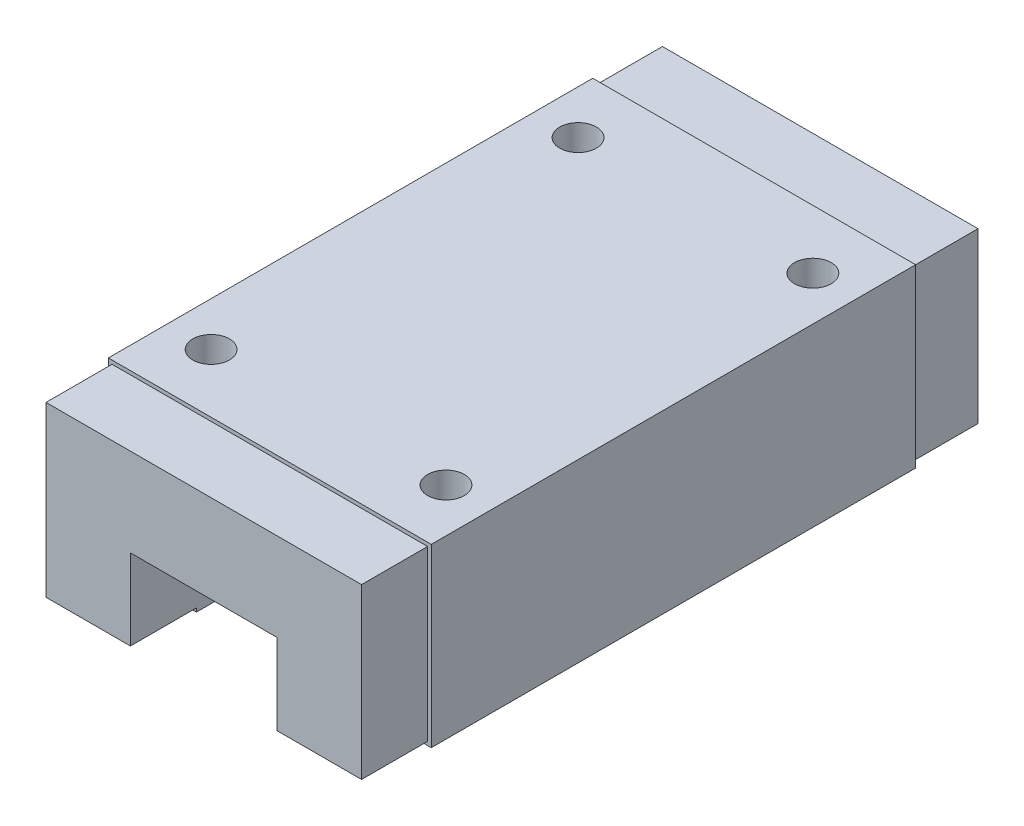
from build123d import *

# Parameters (mm, degrees)
SKIZZE1_W                          = 44
SKIZZE1_H                          = 66
LINEAR_AUSTRAGEN1_DEPTH            = 12
SKIZZE2_W                          = 43
SKIZZE2_H                          = 23
LINEAR_AUSTRAGEN2_DEPTH            = 9
SKIZZE3_W                          = 43
SKIZZE3_H                          = 23
LINEAR_AUSTRAGEN3_DEPTH            = 9
SCHNITT_LINEAR_AUSTRAGEN1_REACH    = 89.658
SKIZZE5_W                          = 20
SKIZZE5_H                          = 11.5
M5X0_8_GEWINDEBOHRUNG1_D           = 4.2
M5X0_8_GEWINDEBOHRUNG1_DEPTH       = 12
M5X0_8_GEWINDEBOHRUNG1_CBORE_D     = 5
M5X0_8_GEWINDEBOHRUNG1_CBORE_DEPTH = 10
M5X0_8_GEWINDEBOHRUNG1_TIP         = 1.2618073


with BuildPart() as part:
    # Skizze1 → Linear austragen1 (new, symmetric)
    with BuildSketch(Plane(origin=(0, 0, 0), x_dir=(1, 0, 0), z_dir=(0, 1, 0))):
        Rectangle(SKIZZE1_W, SKIZZE1_H)
    extrude(amount=LINEAR_AUSTRAGEN1_DEPTH, both=True)

    # Skizze2 → Linear austragen2 (add)
    with BuildSketch(Plane.XY.offset(33)):
        Rectangle(SKIZZE2_W, SKIZZE2_H)
    extrude(amount=LINEAR_AUSTRAGEN2_DEPTH)

    # Skizze3 → Linear austragen3 (add)
    with BuildSketch(Plane(origin=(0, 0, -33), x_dir=(-1, 0, 0), z_dir=(0, 0, -1))):
        Rectangle(SKIZZE3_W, SKIZZE3_H)
    extrude(amount=LINEAR_AUSTRAGEN3_DEPTH)

    # Skizze5 → Schnitt-Linear austragen1 (cut, up to next)
    with BuildSketch(Plane.XY.offset(42), mode=Mode.PRIVATE) as schnitt_linear_austragen1_sk1:
        with Locations((0, -6.25)):
            Rectangle(SKIZZE5_W, SKIZZE5_H)
    schnitt_linear_austragen1_tool1 = extrude(schnitt_linear_austragen1_sk1.sketch, amount=-SCHNITT_LINEAR_AUSTRAGEN1_REACH, mode=Mode.PRIVATE) & part.part
    add(schnitt_linear_austragen1_tool1.solids().sort_by_distance((0, -6.25, 42))[0], mode=Mode.SUBTRACT)

    # M5x0.8 Gewindebohrung1
    with Locations(Plane(origin=(0, 12, 0), x_dir=(-1, 0, 0), z_dir=(0, 1, 0))):
        with Locations((16, -25), (-16, -25), (-16, 25), (16, 25)):
            CounterBoreHole(M5X0_8_GEWINDEBOHRUNG1_D / 2, M5X0_8_GEWINDEBOHRUNG1_CBORE_D / 2, M5X0_8_GEWINDEBOHRUNG1_CBORE_DEPTH, depth=M5X0_8_GEWINDEBOHRUNG1_DEPTH)
            with Locations((0, 0, -(M5X0_8_GEWINDEBOHRUNG1_DEPTH + M5X0_8_GEWINDEBOHRUNG1_TIP / 2))):  # 118° drill point
                Cone(0, M5X0_8_GEWINDEBOHRUNG1_D / 2, M5X0_8_GEWINDEBOHRUNG1_TIP, mode=Mode.SUBTRACT)


solid = part.part
